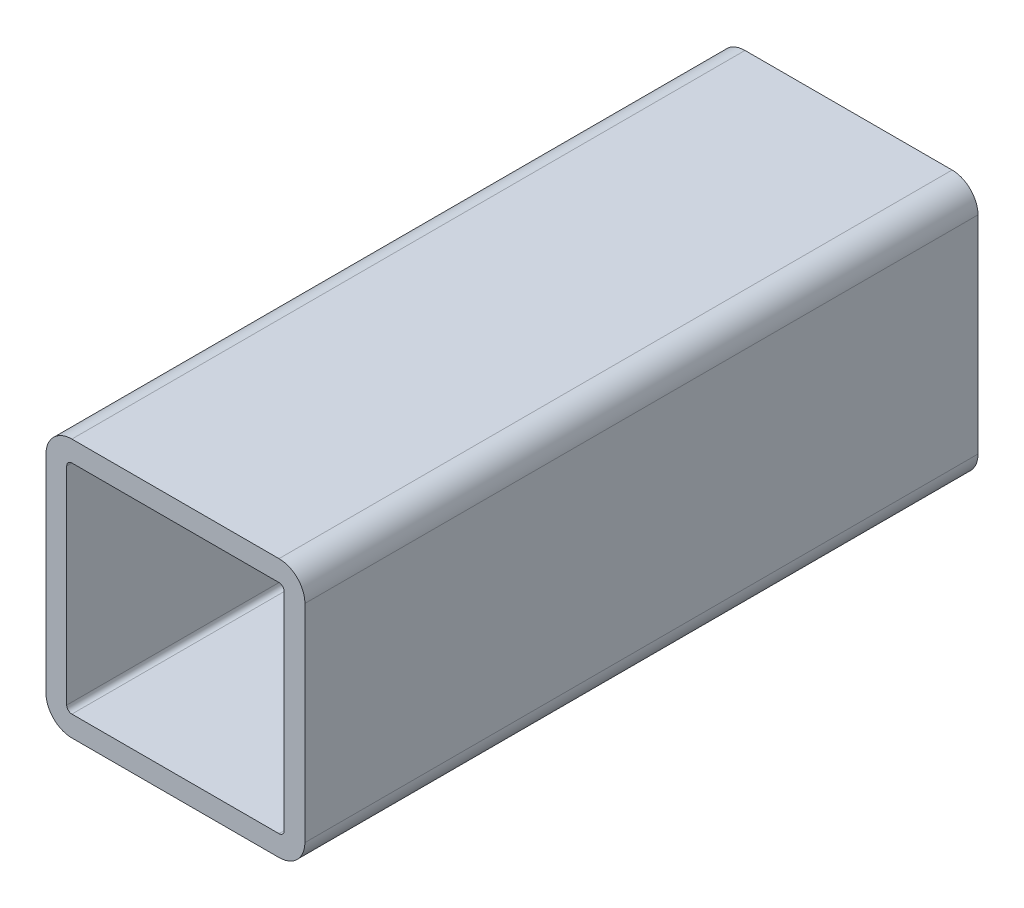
ISO-10303-21;
HEADER;
FILE_DESCRIPTION(('STEP AP214'),'2;1');
FILE_NAME('part.step','',(''),(''),'','','');
FILE_SCHEMA(('AUTOMOTIVE_DESIGN { 1 0 10303 214 1 1 1 1 }'));
ENDSEC;
DATA;
#1=APPLICATION_CONTEXT('core data for automotive mechanical design processes');
#2=APPLICATION_PROTOCOL_DEFINITION('international standard','automotive_design',2000,#1);
#3=PRODUCT_CONTEXT('',#1,'mechanical');
#4=PRODUCT('Part','Part','',(#3));
#5=PRODUCT_RELATED_PRODUCT_CATEGORY('part','',(#4));
#6=PRODUCT_DEFINITION_FORMATION('','',#4);
#7=PRODUCT_DEFINITION_CONTEXT('part definition',#1,'design');
#8=PRODUCT_DEFINITION('design','',#6,#7);
#9=PRODUCT_DEFINITION_SHAPE('','',#8);
#10=(LENGTH_UNIT() NAMED_UNIT(*) SI_UNIT(.MILLI.,.METRE.));
#11=(NAMED_UNIT(*) PLANE_ANGLE_UNIT() SI_UNIT($,.RADIAN.));
#12=(NAMED_UNIT(*) SI_UNIT($,.STERADIAN.) SOLID_ANGLE_UNIT());
#13=UNCERTAINTY_MEASURE_WITH_UNIT(LENGTH_MEASURE(1.E-05),#10,'distance_accuracy_value','');
#14=(GEOMETRIC_REPRESENTATION_CONTEXT(3) GLOBAL_UNCERTAINTY_ASSIGNED_CONTEXT((#13)) GLOBAL_UNIT_ASSIGNED_CONTEXT((#10,
#11,#12)) REPRESENTATION_CONTEXT('',''));
#15=CARTESIAN_POINT('',(0.,0.,0.));
#16=DIRECTION('',(0.,0.,1.));
#17=DIRECTION('',(1.,0.,0.));
#18=AXIS2_PLACEMENT_3D('',#15,#16,#17);
#19=CARTESIAN_POINT('',(45.,-5.,130.));
#20=DIRECTION('',(0.,0.,1.));
#21=DIRECTION('',(1.,0.,0.));
#22=AXIS2_PLACEMENT_3D('',#19,#20,#21);
#23=PLANE('',#22);
#24=CARTESIAN_POINT('',(45.,-5.,130.));
#25=DIRECTION('',(0.,0.,1.));
#26=DIRECTION('',(1.,0.,0.));
#27=AXIS2_PLACEMENT_3D('',#24,#25,#26);
#28=CIRCLE('',#27,5.);
#29=CARTESIAN_POINT('',(50.,-5.00000000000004,130.));
#30=VERTEX_POINT('',#29);
#31=CARTESIAN_POINT('',(45.,0.,130.));
#32=VERTEX_POINT('',#31);
#33=EDGE_CURVE('E222',#30,#32,#28,.T.);
#34=ORIENTED_EDGE('',*,*,#33,.T.);
#35=DIRECTION('',(-1.,0.,0.));
#36=VECTOR('',#35,1.);
#37=CARTESIAN_POINT('',(5.00000000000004,0.,130.));
#38=LINE('',#37,#36);
#39=CARTESIAN_POINT('',(5.00000000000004,0.,130.));
#40=VERTEX_POINT('',#39);
#41=EDGE_CURVE('E225',#32,#40,#38,.T.);
#42=ORIENTED_EDGE('',*,*,#41,.T.);
#43=CARTESIAN_POINT('',(5.,-5.,130.));
#44=DIRECTION('',(0.,0.,1.));
#45=DIRECTION('',(-1.,0.,0.));
#46=AXIS2_PLACEMENT_3D('',#43,#44,#45);
#47=CIRCLE('',#46,5.);
#48=CARTESIAN_POINT('',(0.,-5.00000000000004,130.));
#49=VERTEX_POINT('',#48);
#50=EDGE_CURVE('E227',#40,#49,#47,.T.);
#51=ORIENTED_EDGE('',*,*,#50,.T.);
#52=DIRECTION('',(0.,-1.,0.));
#53=VECTOR('',#52,1.);
#54=CARTESIAN_POINT('',(0.,-5.00000000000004,130.));
#55=LINE('',#54,#53);
#56=CARTESIAN_POINT('',(0.,-45.,130.));
#57=VERTEX_POINT('',#56);
#58=EDGE_CURVE('E229',#49,#57,#55,.T.);
#59=ORIENTED_EDGE('',*,*,#58,.T.);
#60=CARTESIAN_POINT('',(5.00000000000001,-45.,130.));
#61=DIRECTION('',(0.,0.,1.));
#62=DIRECTION('',(-1.,0.,0.));
#63=AXIS2_PLACEMENT_3D('',#60,#61,#62);
#64=CIRCLE('',#63,5.);
#65=CARTESIAN_POINT('',(5.00000000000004,-50.,130.));
#66=VERTEX_POINT('',#65);
#67=EDGE_CURVE('E231',#57,#66,#64,.T.);
#68=ORIENTED_EDGE('',*,*,#67,.T.);
#69=DIRECTION('',(1.,0.,0.));
#70=VECTOR('',#69,1.);
#71=CARTESIAN_POINT('',(5.00000000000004,-50.,130.));
#72=LINE('',#71,#70);
#73=CARTESIAN_POINT('',(45.,-50.,130.));
#74=VERTEX_POINT('',#73);
#75=EDGE_CURVE('E233',#66,#74,#72,.T.);
#76=ORIENTED_EDGE('',*,*,#75,.T.);
#77=CARTESIAN_POINT('',(45.,-45.,130.));
#78=DIRECTION('',(0.,0.,1.));
#79=DIRECTION('',(-1.,0.,0.));
#80=AXIS2_PLACEMENT_3D('',#77,#78,#79);
#81=CIRCLE('',#80,5.);
#82=CARTESIAN_POINT('',(50.,-45.,130.));
#83=VERTEX_POINT('',#82);
#84=EDGE_CURVE('E235',#74,#83,#81,.T.);
#85=ORIENTED_EDGE('',*,*,#84,.T.);
#86=DIRECTION('',(0.,1.,0.));
#87=VECTOR('',#86,1.);
#88=CARTESIAN_POINT('',(50.,-5.00000000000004,130.));
#89=LINE('',#88,#87);
#90=EDGE_CURVE('E237',#83,#30,#89,.T.);
#91=ORIENTED_EDGE('',*,*,#90,.T.);
#92=EDGE_LOOP('',(#34,#42,#51,#59,#68,#76,#85,#91));
#93=FACE_BOUND('',#92,.T.);
#94=DIRECTION('',(0.,-1.,0.));
#95=VECTOR('',#94,1.);
#96=CARTESIAN_POINT('',(4.,-5.00000000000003,130.));
#97=LINE('',#96,#95);
#98=CARTESIAN_POINT('',(4.,-5.00000000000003,130.));
#99=VERTEX_POINT('',#98);
#100=CARTESIAN_POINT('',(4.00000000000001,-45.,130.));
#101=VERTEX_POINT('',#100);
#102=EDGE_CURVE('E180',#99,#101,#97,.T.);
#103=ORIENTED_EDGE('',*,*,#102,.F.);
#104=CARTESIAN_POINT('',(5.,-5.,130.));
#105=DIRECTION('',(0.,0.,1.));
#106=DIRECTION('',(-1.,0.,0.));
#107=AXIS2_PLACEMENT_3D('',#104,#105,#106);
#108=CIRCLE('',#107,0.999999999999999);
#109=CARTESIAN_POINT('',(5.00000000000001,-4.,130.));
#110=VERTEX_POINT('',#109);
#111=EDGE_CURVE('E157',#110,#99,#108,.T.);
#112=ORIENTED_EDGE('',*,*,#111,.F.);
#113=DIRECTION('',(-1.,0.,0.));
#114=VECTOR('',#113,1.);
#115=CARTESIAN_POINT('',(5.00000000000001,-4.,130.));
#116=LINE('',#115,#114);
#117=CARTESIAN_POINT('',(45.,-4.,130.));
#118=VERTEX_POINT('',#117);
#119=EDGE_CURVE('E192',#118,#110,#116,.T.);
#120=ORIENTED_EDGE('',*,*,#119,.F.);
#121=CARTESIAN_POINT('',(45.,-5.,130.));
#122=DIRECTION('',(0.,0.,1.));
#123=DIRECTION('',(1.,0.,0.));
#124=AXIS2_PLACEMENT_3D('',#121,#122,#123);
#125=CIRCLE('',#124,1.);
#126=CARTESIAN_POINT('',(46.,-5.00000000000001,130.));
#127=VERTEX_POINT('',#126);
#128=EDGE_CURVE('E190',#127,#118,#125,.T.);
#129=ORIENTED_EDGE('',*,*,#128,.F.);
#130=DIRECTION('',(0.,1.,0.));
#131=VECTOR('',#130,1.);
#132=CARTESIAN_POINT('',(46.,-5.00000000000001,130.));
#133=LINE('',#132,#131);
#134=CARTESIAN_POINT('',(46.,-45.,130.));
#135=VERTEX_POINT('',#134);
#136=EDGE_CURVE('E188',#135,#127,#133,.T.);
#137=ORIENTED_EDGE('',*,*,#136,.F.);
#138=CARTESIAN_POINT('',(45.,-45.,130.));
#139=DIRECTION('',(0.,0.,1.));
#140=DIRECTION('',(-1.,0.,0.));
#141=AXIS2_PLACEMENT_3D('',#138,#139,#140);
#142=CIRCLE('',#141,0.999999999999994);
#143=CARTESIAN_POINT('',(45.,-46.,130.));
#144=VERTEX_POINT('',#143);
#145=EDGE_CURVE('E186',#144,#135,#142,.T.);
#146=ORIENTED_EDGE('',*,*,#145,.F.);
#147=DIRECTION('',(1.,0.,0.));
#148=VECTOR('',#147,1.);
#149=CARTESIAN_POINT('',(5.00000000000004,-46.,130.));
#150=LINE('',#149,#148);
#151=CARTESIAN_POINT('',(5.00000000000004,-46.,130.));
#152=VERTEX_POINT('',#151);
#153=EDGE_CURVE('E184',#152,#144,#150,.T.);
#154=ORIENTED_EDGE('',*,*,#153,.F.);
#155=CARTESIAN_POINT('',(5.00000000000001,-45.,130.));
#156=DIRECTION('',(0.,0.,1.));
#157=DIRECTION('',(-1.,0.,0.));
#158=AXIS2_PLACEMENT_3D('',#155,#156,#157);
#159=CIRCLE('',#158,0.999999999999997);
#160=EDGE_CURVE('E182',#101,#152,#159,.T.);
#161=ORIENTED_EDGE('',*,*,#160,.F.);
#162=EDGE_LOOP('',(#103,#112,#120,#129,#137,#146,#154,#161));
#163=FACE_BOUND('',#162,.T.);
#164=ADVANCED_FACE('F29',(#93,#163),#23,.T.);
#165=CARTESIAN_POINT('',(45.,-5.,0.));
#166=DIRECTION('',(0.,0.,1.));
#167=DIRECTION('',(1.,0.,0.));
#168=AXIS2_PLACEMENT_3D('',#165,#166,#167);
#169=PLANE('',#168);
#170=CARTESIAN_POINT('',(45.,-5.,0.));
#171=DIRECTION('',(0.,0.,1.));
#172=DIRECTION('',(1.,0.,0.));
#173=AXIS2_PLACEMENT_3D('',#170,#171,#172);
#174=CIRCLE('',#173,5.);
#175=CARTESIAN_POINT('',(50.,-5.00000000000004,0.));
#176=VERTEX_POINT('',#175);
#177=CARTESIAN_POINT('',(45.,0.,0.));
#178=VERTEX_POINT('',#177);
#179=EDGE_CURVE('E158',#176,#178,#174,.T.);
#180=ORIENTED_EDGE('',*,*,#179,.F.);
#181=DIRECTION('',(0.,1.,0.));
#182=VECTOR('',#181,1.);
#183=CARTESIAN_POINT('',(50.,-5.00000000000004,0.));
#184=LINE('',#183,#182);
#185=CARTESIAN_POINT('',(50.,-45.,0.));
#186=VERTEX_POINT('',#185);
#187=EDGE_CURVE('E220',#186,#176,#184,.T.);
#188=ORIENTED_EDGE('',*,*,#187,.F.);
#189=CARTESIAN_POINT('',(45.,-45.,0.));
#190=DIRECTION('',(0.,0.,1.));
#191=DIRECTION('',(-1.,0.,0.));
#192=AXIS2_PLACEMENT_3D('',#189,#190,#191);
#193=CIRCLE('',#192,5.);
#194=CARTESIAN_POINT('',(45.,-50.,0.));
#195=VERTEX_POINT('',#194);
#196=EDGE_CURVE('E218',#195,#186,#193,.T.);
#197=ORIENTED_EDGE('',*,*,#196,.F.);
#198=DIRECTION('',(1.,0.,0.));
#199=VECTOR('',#198,1.);
#200=CARTESIAN_POINT('',(5.00000000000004,-50.,0.));
#201=LINE('',#200,#199);
#202=CARTESIAN_POINT('',(5.00000000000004,-50.,0.));
#203=VERTEX_POINT('',#202);
#204=EDGE_CURVE('E216',#203,#195,#201,.T.);
#205=ORIENTED_EDGE('',*,*,#204,.F.);
#206=CARTESIAN_POINT('',(5.00000000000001,-45.,0.));
#207=DIRECTION('',(0.,0.,1.));
#208=DIRECTION('',(-1.,0.,0.));
#209=AXIS2_PLACEMENT_3D('',#206,#207,#208);
#210=CIRCLE('',#209,5.);
#211=CARTESIAN_POINT('',(0.,-45.,0.));
#212=VERTEX_POINT('',#211);
#213=EDGE_CURVE('E214',#212,#203,#210,.T.);
#214=ORIENTED_EDGE('',*,*,#213,.F.);
#215=DIRECTION('',(0.,-1.,0.));
#216=VECTOR('',#215,1.);
#217=CARTESIAN_POINT('',(0.,-5.00000000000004,0.));
#218=LINE('',#217,#216);
#219=CARTESIAN_POINT('',(0.,-5.00000000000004,0.));
#220=VERTEX_POINT('',#219);
#221=EDGE_CURVE('E212',#220,#212,#218,.T.);
#222=ORIENTED_EDGE('',*,*,#221,.F.);
#223=CARTESIAN_POINT('',(5.,-5.,0.));
#224=DIRECTION('',(0.,0.,1.));
#225=DIRECTION('',(-1.,0.,0.));
#226=AXIS2_PLACEMENT_3D('',#223,#224,#225);
#227=CIRCLE('',#226,5.);
#228=CARTESIAN_POINT('',(5.00000000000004,0.,0.));
#229=VERTEX_POINT('',#228);
#230=EDGE_CURVE('E210',#229,#220,#227,.T.);
#231=ORIENTED_EDGE('',*,*,#230,.F.);
#232=DIRECTION('',(-1.,0.,0.));
#233=VECTOR('',#232,1.);
#234=CARTESIAN_POINT('',(5.00000000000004,0.,0.));
#235=LINE('',#234,#233);
#236=EDGE_CURVE('E208',#178,#229,#235,.T.);
#237=ORIENTED_EDGE('',*,*,#236,.F.);
#238=EDGE_LOOP('',(#180,#188,#197,#205,#214,#222,#231,#237));
#239=FACE_BOUND('',#238,.T.);
#240=CARTESIAN_POINT('',(5.,-5.,0.));
#241=DIRECTION('',(0.,0.,1.));
#242=DIRECTION('',(-1.,0.,0.));
#243=AXIS2_PLACEMENT_3D('',#240,#241,#242);
#244=CIRCLE('',#243,0.999999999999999);
#245=CARTESIAN_POINT('',(5.00000000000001,-4.,0.));
#246=VERTEX_POINT('',#245);
#247=CARTESIAN_POINT('',(4.,-5.00000000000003,0.));
#248=VERTEX_POINT('',#247);
#249=EDGE_CURVE('E52',#246,#248,#244,.T.);
#250=ORIENTED_EDGE('',*,*,#249,.T.);
#251=DIRECTION('',(0.,-1.,0.));
#252=VECTOR('',#251,1.);
#253=CARTESIAN_POINT('',(4.,-5.00000000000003,0.));
#254=LINE('',#253,#252);
#255=CARTESIAN_POINT('',(4.00000000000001,-45.,0.));
#256=VERTEX_POINT('',#255);
#257=EDGE_CURVE('E144',#248,#256,#254,.T.);
#258=ORIENTED_EDGE('',*,*,#257,.T.);
#259=CARTESIAN_POINT('',(5.00000000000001,-45.,0.));
#260=DIRECTION('',(0.,0.,1.));
#261=DIRECTION('',(-1.,0.,0.));
#262=AXIS2_PLACEMENT_3D('',#259,#260,#261);
#263=CIRCLE('',#262,0.999999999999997);
#264=CARTESIAN_POINT('',(5.00000000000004,-46.,0.));
#265=VERTEX_POINT('',#264);
#266=EDGE_CURVE('E153',#256,#265,#263,.T.);
#267=ORIENTED_EDGE('',*,*,#266,.T.);
#268=DIRECTION('',(1.,0.,0.));
#269=VECTOR('',#268,1.);
#270=CARTESIAN_POINT('',(5.00000000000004,-46.,0.));
#271=LINE('',#270,#269);
#272=CARTESIAN_POINT('',(45.,-46.,0.));
#273=VERTEX_POINT('',#272);
#274=EDGE_CURVE('E167',#265,#273,#271,.T.);
#275=ORIENTED_EDGE('',*,*,#274,.T.);
#276=CARTESIAN_POINT('',(45.,-45.,0.));
#277=DIRECTION('',(0.,0.,1.));
#278=DIRECTION('',(-1.,0.,0.));
#279=AXIS2_PLACEMENT_3D('',#276,#277,#278);
#280=CIRCLE('',#279,0.999999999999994);
#281=CARTESIAN_POINT('',(46.,-45.,0.));
#282=VERTEX_POINT('',#281);
#283=EDGE_CURVE('E170',#273,#282,#280,.T.);
#284=ORIENTED_EDGE('',*,*,#283,.T.);
#285=DIRECTION('',(0.,1.,0.));
#286=VECTOR('',#285,1.);
#287=CARTESIAN_POINT('',(46.,-5.00000000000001,0.));
#288=LINE('',#287,#286);
#289=CARTESIAN_POINT('',(46.,-5.00000000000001,0.));
#290=VERTEX_POINT('',#289);
#291=EDGE_CURVE('E173',#282,#290,#288,.T.);
#292=ORIENTED_EDGE('',*,*,#291,.T.);
#293=CARTESIAN_POINT('',(45.,-5.,0.));
#294=DIRECTION('',(0.,0.,1.));
#295=DIRECTION('',(1.,0.,0.));
#296=AXIS2_PLACEMENT_3D('',#293,#294,#295);
#297=CIRCLE('',#296,1.);
#298=CARTESIAN_POINT('',(45.,-4.,0.));
#299=VERTEX_POINT('',#298);
#300=EDGE_CURVE('E176',#290,#299,#297,.T.);
#301=ORIENTED_EDGE('',*,*,#300,.T.);
#302=DIRECTION('',(-1.,0.,0.));
#303=VECTOR('',#302,1.);
#304=CARTESIAN_POINT('',(5.00000000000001,-4.,0.));
#305=LINE('',#304,#303);
#306=EDGE_CURVE('E163',#299,#246,#305,.T.);
#307=ORIENTED_EDGE('',*,*,#306,.T.);
#308=EDGE_LOOP('',(#250,#258,#267,#275,#284,#292,#301,#307));
#309=FACE_BOUND('',#308,.T.);
#310=ADVANCED_FACE('F161',(#239,#309),#169,.F.);
#311=CARTESIAN_POINT('',(45.,-5.,130.));
#312=DIRECTION('',(0.,0.,-1.));
#313=DIRECTION('',(-1.,0.,0.));
#314=AXIS2_PLACEMENT_3D('',#311,#312,#313);
#315=CYLINDRICAL_SURFACE('',#314,5.);
#316=ORIENTED_EDGE('',*,*,#179,.T.);
#317=DIRECTION('',(0.,0.,-1.));
#318=VECTOR('',#317,1.);
#319=CARTESIAN_POINT('',(45.,0.,130.));
#320=LINE('',#319,#318);
#321=EDGE_CURVE('E11',#32,#178,#320,.T.);
#322=ORIENTED_EDGE('',*,*,#321,.F.);
#323=ORIENTED_EDGE('',*,*,#33,.F.);
#324=DIRECTION('',(0.,0.,-1.));
#325=VECTOR('',#324,1.);
#326=CARTESIAN_POINT('',(50.,-5.00000000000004,130.));
#327=LINE('',#326,#325);
#328=EDGE_CURVE('E239',#30,#176,#327,.T.);
#329=ORIENTED_EDGE('',*,*,#328,.T.);
#330=EDGE_LOOP('',(#316,#322,#323,#329));
#331=FACE_BOUND('',#330,.T.);
#332=ADVANCED_FACE('F31',(#331),#315,.T.);
#333=CARTESIAN_POINT('',(5.00000000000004,0.,130.));
#334=DIRECTION('',(0.,-1.,0.));
#335=DIRECTION('',(0.,0.,-1.));
#336=AXIS2_PLACEMENT_3D('',#333,#334,#335);
#337=PLANE('',#336);
#338=ORIENTED_EDGE('',*,*,#236,.T.);
#339=DIRECTION('',(0.,0.,-1.));
#340=VECTOR('',#339,1.);
#341=CARTESIAN_POINT('',(5.00000000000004,0.,130.));
#342=LINE('',#341,#340);
#343=EDGE_CURVE('E37',#40,#229,#342,.T.);
#344=ORIENTED_EDGE('',*,*,#343,.F.);
#345=ORIENTED_EDGE('',*,*,#41,.F.);
#346=ORIENTED_EDGE('',*,*,#321,.T.);
#347=EDGE_LOOP('',(#338,#344,#345,#346));
#348=FACE_BOUND('',#347,.T.);
#349=ADVANCED_FACE('F283',(#348),#337,.F.);
#350=CARTESIAN_POINT('',(5.,-5.,130.));
#351=DIRECTION('',(0.,0.,-1.));
#352=DIRECTION('',(-1.,0.,0.));
#353=AXIS2_PLACEMENT_3D('',#350,#351,#352);
#354=CYLINDRICAL_SURFACE('',#353,5.);
#355=ORIENTED_EDGE('',*,*,#230,.T.);
#356=DIRECTION('',(0.,0.,-1.));
#357=VECTOR('',#356,1.);
#358=CARTESIAN_POINT('',(0.,-5.00000000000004,130.));
#359=LINE('',#358,#357);
#360=EDGE_CURVE('E254',#49,#220,#359,.T.);
#361=ORIENTED_EDGE('',*,*,#360,.F.);
#362=ORIENTED_EDGE('',*,*,#50,.F.);
#363=ORIENTED_EDGE('',*,*,#343,.T.);
#364=EDGE_LOOP('',(#355,#361,#362,#363));
#365=FACE_BOUND('',#364,.T.);
#366=ADVANCED_FACE('F261',(#365),#354,.T.);
#367=CARTESIAN_POINT('',(0.,-5.00000000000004,130.));
#368=DIRECTION('',(1.,0.,0.));
#369=DIRECTION('',(0.,1.,0.));
#370=AXIS2_PLACEMENT_3D('',#367,#368,#369);
#371=PLANE('',#370);
#372=ORIENTED_EDGE('',*,*,#221,.T.);
#373=DIRECTION('',(0.,0.,-1.));
#374=VECTOR('',#373,1.);
#375=CARTESIAN_POINT('',(0.,-45.,130.));
#376=LINE('',#375,#374);
#377=EDGE_CURVE('E251',#57,#212,#376,.T.);
#378=ORIENTED_EDGE('',*,*,#377,.F.);
#379=ORIENTED_EDGE('',*,*,#58,.F.);
#380=ORIENTED_EDGE('',*,*,#360,.T.);
#381=EDGE_LOOP('',(#372,#378,#379,#380));
#382=FACE_BOUND('',#381,.T.);
#383=ADVANCED_FACE('F271',(#382),#371,.F.);
#384=CARTESIAN_POINT('',(5.00000000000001,-45.,130.));
#385=DIRECTION('',(0.,0.,-1.));
#386=DIRECTION('',(-1.,0.,0.));
#387=AXIS2_PLACEMENT_3D('',#384,#385,#386);
#388=CYLINDRICAL_SURFACE('',#387,5.);
#389=ORIENTED_EDGE('',*,*,#213,.T.);
#390=DIRECTION('',(0.,0.,-1.));
#391=VECTOR('',#390,1.);
#392=CARTESIAN_POINT('',(5.00000000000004,-50.,130.));
#393=LINE('',#392,#391);
#394=EDGE_CURVE('E248',#66,#203,#393,.T.);
#395=ORIENTED_EDGE('',*,*,#394,.F.);
#396=ORIENTED_EDGE('',*,*,#67,.F.);
#397=ORIENTED_EDGE('',*,*,#377,.T.);
#398=EDGE_LOOP('',(#389,#395,#396,#397));
#399=FACE_BOUND('',#398,.T.);
#400=ADVANCED_FACE('F275',(#399),#388,.T.);
#401=CARTESIAN_POINT('',(5.00000000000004,-50.,130.));
#402=DIRECTION('',(0.,1.,0.));
#403=DIRECTION('',(0.,0.,1.));
#404=AXIS2_PLACEMENT_3D('',#401,#402,#403);
#405=PLANE('',#404);
#406=ORIENTED_EDGE('',*,*,#204,.T.);
#407=DIRECTION('',(0.,0.,-1.));
#408=VECTOR('',#407,1.);
#409=CARTESIAN_POINT('',(45.,-50.,130.));
#410=LINE('',#409,#408);
#411=EDGE_CURVE('E245',#74,#195,#410,.T.);
#412=ORIENTED_EDGE('',*,*,#411,.F.);
#413=ORIENTED_EDGE('',*,*,#75,.F.);
#414=ORIENTED_EDGE('',*,*,#394,.T.);
#415=EDGE_LOOP('',(#406,#412,#413,#414));
#416=FACE_BOUND('',#415,.T.);
#417=ADVANCED_FACE('F296',(#416),#405,.F.);
#418=CARTESIAN_POINT('',(45.,-45.,130.));
#419=DIRECTION('',(0.,0.,-1.));
#420=DIRECTION('',(-1.,0.,0.));
#421=AXIS2_PLACEMENT_3D('',#418,#419,#420);
#422=CYLINDRICAL_SURFACE('',#421,5.);
#423=ORIENTED_EDGE('',*,*,#196,.T.);
#424=DIRECTION('',(0.,0.,-1.));
#425=VECTOR('',#424,1.);
#426=CARTESIAN_POINT('',(50.,-45.,130.));
#427=LINE('',#426,#425);
#428=EDGE_CURVE('E242',#83,#186,#427,.T.);
#429=ORIENTED_EDGE('',*,*,#428,.F.);
#430=ORIENTED_EDGE('',*,*,#84,.F.);
#431=ORIENTED_EDGE('',*,*,#411,.T.);
#432=EDGE_LOOP('',(#423,#429,#430,#431));
#433=FACE_BOUND('',#432,.T.);
#434=ADVANCED_FACE('F294',(#433),#422,.T.);
#435=CARTESIAN_POINT('',(50.,-5.00000000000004,130.));
#436=DIRECTION('',(-1.,0.,0.));
#437=DIRECTION('',(0.,0.,1.));
#438=AXIS2_PLACEMENT_3D('',#435,#436,#437);
#439=PLANE('',#438);
#440=ORIENTED_EDGE('',*,*,#187,.T.);
#441=ORIENTED_EDGE('',*,*,#328,.F.);
#442=ORIENTED_EDGE('',*,*,#90,.F.);
#443=ORIENTED_EDGE('',*,*,#428,.T.);
#444=EDGE_LOOP('',(#440,#441,#442,#443));
#445=FACE_BOUND('',#444,.T.);
#446=ADVANCED_FACE('F289',(#445),#439,.F.);
#447=CARTESIAN_POINT('',(5.,-5.,130.));
#448=DIRECTION('',(0.,0.,-1.));
#449=DIRECTION('',(-1.,0.,0.));
#450=AXIS2_PLACEMENT_3D('',#447,#448,#449);
#451=CYLINDRICAL_SURFACE('',#450,0.999999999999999);
#452=ORIENTED_EDGE('',*,*,#249,.F.);
#453=DIRECTION('',(0.,0.,-1.));
#454=VECTOR('',#453,1.);
#455=CARTESIAN_POINT('',(5.00000000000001,-4.,130.));
#456=LINE('',#455,#454);
#457=EDGE_CURVE('E194',#110,#246,#456,.T.);
#458=ORIENTED_EDGE('',*,*,#457,.F.);
#459=ORIENTED_EDGE('',*,*,#111,.T.);
#460=DIRECTION('',(0.,0.,-1.));
#461=VECTOR('',#460,1.);
#462=CARTESIAN_POINT('',(4.,-5.00000000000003,130.));
#463=LINE('',#462,#461);
#464=EDGE_CURVE('E146',#99,#248,#463,.T.);
#465=ORIENTED_EDGE('',*,*,#464,.T.);
#466=EDGE_LOOP('',(#452,#458,#459,#465));
#467=FACE_BOUND('',#466,.T.);
#468=ADVANCED_FACE('F155',(#467),#451,.F.);
#469=CARTESIAN_POINT('',(4.,-5.00000000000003,130.));
#470=DIRECTION('',(1.,0.,0.));
#471=DIRECTION('',(0.,1.,0.));
#472=AXIS2_PLACEMENT_3D('',#469,#470,#471);
#473=PLANE('',#472);
#474=ORIENTED_EDGE('',*,*,#257,.F.);
#475=ORIENTED_EDGE('',*,*,#464,.F.);
#476=ORIENTED_EDGE('',*,*,#102,.T.);
#477=DIRECTION('',(0.,0.,-1.));
#478=VECTOR('',#477,1.);
#479=CARTESIAN_POINT('',(4.00000000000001,-45.,130.));
#480=LINE('',#479,#478);
#481=EDGE_CURVE('E149',#101,#256,#480,.T.);
#482=ORIENTED_EDGE('',*,*,#481,.T.);
#483=EDGE_LOOP('',(#474,#475,#476,#482));
#484=FACE_BOUND('',#483,.T.);
#485=ADVANCED_FACE('F145',(#484),#473,.T.);
#486=CARTESIAN_POINT('',(5.00000000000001,-45.,130.));
#487=DIRECTION('',(0.,0.,-1.));
#488=DIRECTION('',(-1.,0.,0.));
#489=AXIS2_PLACEMENT_3D('',#486,#487,#488);
#490=CYLINDRICAL_SURFACE('',#489,0.999999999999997);
#491=ORIENTED_EDGE('',*,*,#266,.F.);
#492=ORIENTED_EDGE('',*,*,#481,.F.);
#493=ORIENTED_EDGE('',*,*,#160,.T.);
#494=DIRECTION('',(0.,0.,-1.));
#495=VECTOR('',#494,1.);
#496=CARTESIAN_POINT('',(5.00000000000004,-46.,130.));
#497=LINE('',#496,#495);
#498=EDGE_CURVE('E203',#152,#265,#497,.T.);
#499=ORIENTED_EDGE('',*,*,#498,.T.);
#500=EDGE_LOOP('',(#491,#492,#493,#499));
#501=FACE_BOUND('',#500,.T.);
#502=ADVANCED_FACE('F320',(#501),#490,.F.);
#503=CARTESIAN_POINT('',(5.00000000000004,-46.,130.));
#504=DIRECTION('',(0.,1.,0.));
#505=DIRECTION('',(0.,0.,1.));
#506=AXIS2_PLACEMENT_3D('',#503,#504,#505);
#507=PLANE('',#506);
#508=ORIENTED_EDGE('',*,*,#274,.F.);
#509=ORIENTED_EDGE('',*,*,#498,.F.);
#510=ORIENTED_EDGE('',*,*,#153,.T.);
#511=DIRECTION('',(0.,0.,-1.));
#512=VECTOR('',#511,1.);
#513=CARTESIAN_POINT('',(45.,-46.,130.));
#514=LINE('',#513,#512);
#515=EDGE_CURVE('E201',#144,#273,#514,.T.);
#516=ORIENTED_EDGE('',*,*,#515,.T.);
#517=EDGE_LOOP('',(#508,#509,#510,#516));
#518=FACE_BOUND('',#517,.T.);
#519=ADVANCED_FACE('F325',(#518),#507,.T.);
#520=CARTESIAN_POINT('',(45.,-45.,130.));
#521=DIRECTION('',(0.,0.,-1.));
#522=DIRECTION('',(-1.,0.,0.));
#523=AXIS2_PLACEMENT_3D('',#520,#521,#522);
#524=CYLINDRICAL_SURFACE('',#523,0.999999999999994);
#525=ORIENTED_EDGE('',*,*,#283,.F.);
#526=ORIENTED_EDGE('',*,*,#515,.F.);
#527=ORIENTED_EDGE('',*,*,#145,.T.);
#528=DIRECTION('',(0.,0.,-1.));
#529=VECTOR('',#528,1.);
#530=CARTESIAN_POINT('',(46.,-45.,130.));
#531=LINE('',#530,#529);
#532=EDGE_CURVE('E199',#135,#282,#531,.T.);
#533=ORIENTED_EDGE('',*,*,#532,.T.);
#534=EDGE_LOOP('',(#525,#526,#527,#533));
#535=FACE_BOUND('',#534,.T.);
#536=ADVANCED_FACE('F329',(#535),#524,.F.);
#537=CARTESIAN_POINT('',(46.,-5.00000000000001,130.));
#538=DIRECTION('',(-1.,0.,0.));
#539=DIRECTION('',(0.,-1.,0.));
#540=AXIS2_PLACEMENT_3D('',#537,#538,#539);
#541=PLANE('',#540);
#542=ORIENTED_EDGE('',*,*,#291,.F.);
#543=ORIENTED_EDGE('',*,*,#532,.F.);
#544=ORIENTED_EDGE('',*,*,#136,.T.);
#545=DIRECTION('',(0.,0.,-1.));
#546=VECTOR('',#545,1.);
#547=CARTESIAN_POINT('',(46.,-5.00000000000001,130.));
#548=LINE('',#547,#546);
#549=EDGE_CURVE('E197',#127,#290,#548,.T.);
#550=ORIENTED_EDGE('',*,*,#549,.T.);
#551=EDGE_LOOP('',(#542,#543,#544,#550));
#552=FACE_BOUND('',#551,.T.);
#553=ADVANCED_FACE('F333',(#552),#541,.T.);
#554=CARTESIAN_POINT('',(45.,-5.,130.));
#555=DIRECTION('',(0.,0.,-1.));
#556=DIRECTION('',(-1.,0.,0.));
#557=AXIS2_PLACEMENT_3D('',#554,#555,#556);
#558=CYLINDRICAL_SURFACE('',#557,1.);
#559=ORIENTED_EDGE('',*,*,#300,.F.);
#560=ORIENTED_EDGE('',*,*,#549,.F.);
#561=ORIENTED_EDGE('',*,*,#128,.T.);
#562=DIRECTION('',(0.,0.,-1.));
#563=VECTOR('',#562,1.);
#564=CARTESIAN_POINT('',(45.,-4.,130.));
#565=LINE('',#564,#563);
#566=EDGE_CURVE('E44',#118,#299,#565,.T.);
#567=ORIENTED_EDGE('',*,*,#566,.T.);
#568=EDGE_LOOP('',(#559,#560,#561,#567));
#569=FACE_BOUND('',#568,.T.);
#570=ADVANCED_FACE('F337',(#569),#558,.F.);
#571=CARTESIAN_POINT('',(5.00000000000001,-4.,130.));
#572=DIRECTION('',(0.,-1.,0.));
#573=DIRECTION('',(0.,0.,-1.));
#574=AXIS2_PLACEMENT_3D('',#571,#572,#573);
#575=PLANE('',#574);
#576=ORIENTED_EDGE('',*,*,#306,.F.);
#577=ORIENTED_EDGE('',*,*,#566,.F.);
#578=ORIENTED_EDGE('',*,*,#119,.T.);
#579=ORIENTED_EDGE('',*,*,#457,.T.);
#580=EDGE_LOOP('',(#576,#577,#578,#579));
#581=FACE_BOUND('',#580,.T.);
#582=ADVANCED_FACE('F341',(#581),#575,.T.);
#583=CLOSED_SHELL('',(#164,#310,#332,#349,#366,#383,#400,#417,#434,#446,#468,#485,#502,#519,
#536,#553,#570,#582));
#584=MANIFOLD_SOLID_BREP('B2',#583);
#585=ADVANCED_BREP_SHAPE_REPRESENTATION('',(#18,#584),#14);
#586=SHAPE_DEFINITION_REPRESENTATION(#9,#585);
ENDSEC;
END-ISO-10303-21;
